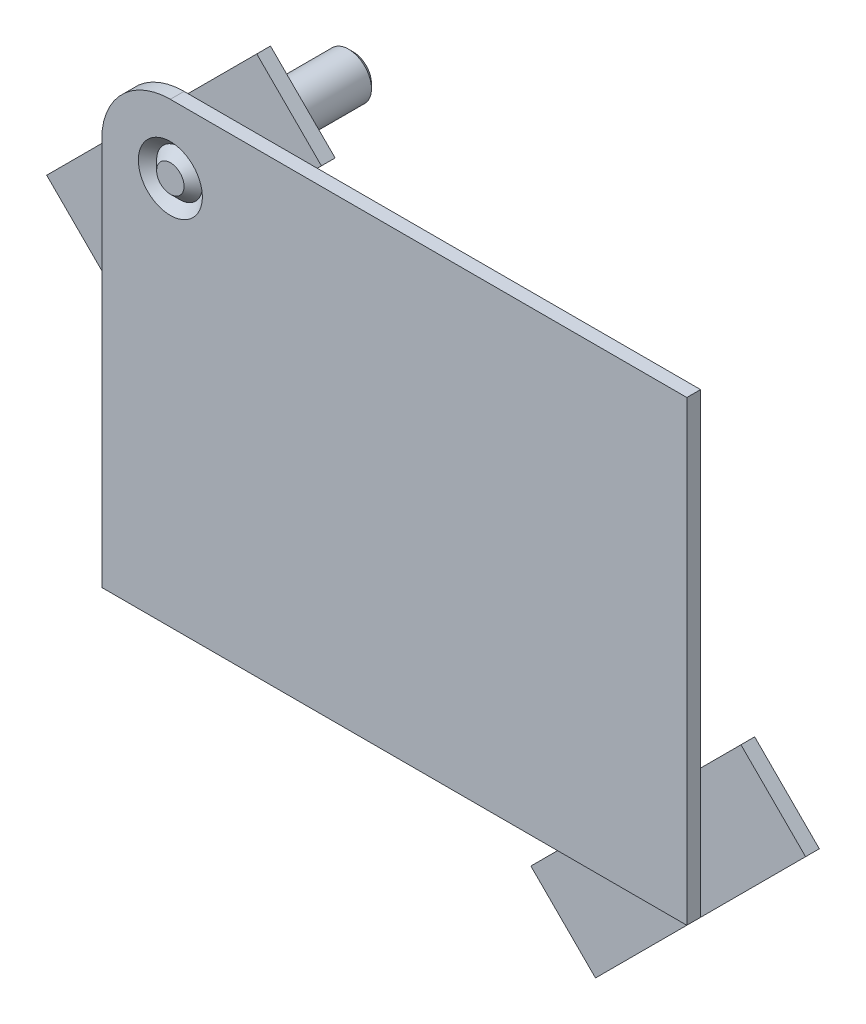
ISO-10303-21;
HEADER;
FILE_DESCRIPTION(('STEP AP214'),'2;1');
FILE_NAME('part.step','',(''),(''),'','','');
FILE_SCHEMA(('AUTOMOTIVE_DESIGN { 1 0 10303 214 1 1 1 1 }'));
ENDSEC;
DATA;
#1=APPLICATION_CONTEXT('core data for automotive mechanical design processes');
#2=APPLICATION_PROTOCOL_DEFINITION('international standard','automotive_design',2000,#1);
#3=PRODUCT_CONTEXT('',#1,'mechanical');
#4=PRODUCT('Part','Part','',(#3));
#5=PRODUCT_RELATED_PRODUCT_CATEGORY('part','',(#4));
#6=PRODUCT_DEFINITION_FORMATION('','',#4);
#7=PRODUCT_DEFINITION_CONTEXT('part definition',#1,'design');
#8=PRODUCT_DEFINITION('design','',#6,#7);
#9=PRODUCT_DEFINITION_SHAPE('','',#8);
#10=(LENGTH_UNIT() NAMED_UNIT(*) SI_UNIT(.MILLI.,.METRE.));
#11=(NAMED_UNIT(*) PLANE_ANGLE_UNIT() SI_UNIT($,.RADIAN.));
#12=(NAMED_UNIT(*) SI_UNIT($,.STERADIAN.) SOLID_ANGLE_UNIT());
#13=UNCERTAINTY_MEASURE_WITH_UNIT(LENGTH_MEASURE(1.E-05),#10,'distance_accuracy_value','');
#14=(GEOMETRIC_REPRESENTATION_CONTEXT(3) GLOBAL_UNCERTAINTY_ASSIGNED_CONTEXT((#13)) GLOBAL_UNIT_ASSIGNED_CONTEXT((#10,
#11,#12)) REPRESENTATION_CONTEXT('',''));
#15=CARTESIAN_POINT('',(0.,0.,0.));
#16=DIRECTION('',(0.,0.,1.));
#17=DIRECTION('',(1.,0.,0.));
#18=AXIS2_PLACEMENT_3D('',#15,#16,#17);
#19=CARTESIAN_POINT('',(-22.7615423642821,21.3249619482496,-3.));
#20=DIRECTION('',(0.,0.,1.));
#21=DIRECTION('',(1.,0.,0.));
#22=AXIS2_PLACEMENT_3D('',#19,#20,#21);
#23=CYLINDRICAL_SURFACE('',#22,5.);
#24=CARTESIAN_POINT('',(-22.7615423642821,21.3249619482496,1.));
#25=DIRECTION('',(0.,0.,1.));
#26=DIRECTION('',(1.,0.,0.));
#27=AXIS2_PLACEMENT_3D('',#24,#25,#26);
#28=CIRCLE('',#27,4.99999999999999);
#29=CARTESIAN_POINT('',(-17.7615423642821,21.3249619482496,1.));
#30=VERTEX_POINT('',#29);
#31=EDGE_CURVE('E43',#30,#30,#28,.T.);
#32=ORIENTED_EDGE('',*,*,#31,.F.);
#33=EDGE_LOOP('',(#32));
#34=FACE_BOUND('',#33,.T.);
#35=CARTESIAN_POINT('',(-22.7615423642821,21.3249619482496,0.));
#36=DIRECTION('',(0.,0.,-1.));
#37=DIRECTION('',(-1.,0.,0.));
#38=AXIS2_PLACEMENT_3D('',#35,#36,#37);
#39=CIRCLE('',#38,5.);
#40=CARTESIAN_POINT('',(-27.7615423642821,21.3249619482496,0.));
#41=VERTEX_POINT('',#40);
#42=EDGE_CURVE('E47',#41,#41,#39,.F.);
#43=ORIENTED_EDGE('',*,*,#42,.T.);
#44=EDGE_LOOP('',(#43));
#45=FACE_BOUND('',#44,.T.);
#46=ADVANCED_FACE('F37',(#34,#45),#23,.T.);
#47=CARTESIAN_POINT('',(-22.7615423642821,21.3249619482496,3.));
#48=DIRECTION('',(0.,0.,-1.));
#49=DIRECTION('',(-1.,0.,0.));
#50=AXIS2_PLACEMENT_3D('',#47,#48,#49);
#51=CONICAL_SURFACE('',#50,3.,0.785398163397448);
#52=ORIENTED_EDGE('',*,*,#31,.T.);
#53=EDGE_LOOP('',(#52));
#54=FACE_BOUND('',#53,.T.);
#55=CARTESIAN_POINT('',(-22.7615423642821,21.3249619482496,3.));
#56=DIRECTION('',(0.,0.,1.));
#57=DIRECTION('',(1.,0.,0.));
#58=AXIS2_PLACEMENT_3D('',#55,#56,#57);
#59=CIRCLE('',#58,3.);
#60=CARTESIAN_POINT('',(-19.7615423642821,21.3249619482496,3.));
#61=VERTEX_POINT('',#60);
#62=EDGE_CURVE('E11',#61,#61,#59,.T.);
#63=ORIENTED_EDGE('',*,*,#62,.F.);
#64=EDGE_LOOP('',(#63));
#65=FACE_BOUND('',#64,.T.);
#66=ADVANCED_FACE('F61',(#54,#65),#51,.T.);
#67=CARTESIAN_POINT('',(-22.7615423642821,21.9642233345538,3.));
#68=DIRECTION('',(0.,0.,1.));
#69=DIRECTION('',(1.,0.,0.));
#70=AXIS2_PLACEMENT_3D('',#67,#68,#69);
#71=PLANE('',#70);
#72=ORIENTED_EDGE('',*,*,#62,.T.);
#73=EDGE_LOOP('',(#72));
#74=FACE_BOUND('',#73,.T.);
#75=ADVANCED_FACE('F57',(#74),#71,.T.);
#76=CARTESIAN_POINT('',(-22.7615423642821,21.3249619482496,0.));
#77=DIRECTION('',(0.,0.,-1.));
#78=DIRECTION('',(-1.,0.,0.));
#79=AXIS2_PLACEMENT_3D('',#76,#77,#78);
#80=PLANE('',#79);
#81=ORIENTED_EDGE('',*,*,#42,.F.);
#82=EDGE_LOOP('',(#81));
#83=FACE_BOUND('',#82,.T.);
#84=ADVANCED_FACE('F55',(#83),#80,.T.);
#85=CLOSED_SHELL('',(#46,#66,#75,#84));
#86=MANIFOLD_SOLID_BREP('B2',#85);
#87=CARTESIAN_POINT('',(-22.7615423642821,25.3249619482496,-37.));
#88=DIRECTION('',(0.,0.,-1.));
#89=DIRECTION('',(-1.,0.,0.));
#90=AXIS2_PLACEMENT_3D('',#87,#88,#89);
#91=PLANE('',#90);
#92=CARTESIAN_POINT('',(-22.7615423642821,21.3249619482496,-37.));
#93=DIRECTION('',(0.,0.,1.));
#94=DIRECTION('',(1.,0.,0.));
#95=AXIS2_PLACEMENT_3D('',#92,#93,#94);
#96=CIRCLE('',#95,4.);
#97=CARTESIAN_POINT('',(-18.7615423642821,21.3249619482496,-37.));
#98=VERTEX_POINT('',#97);
#99=EDGE_CURVE('E36',#98,#98,#96,.T.);
#100=ORIENTED_EDGE('',*,*,#99,.F.);
#101=EDGE_LOOP('',(#100));
#102=FACE_BOUND('',#101,.T.);
#103=ADVANCED_FACE('F105',(#102),#91,.T.);
#104=CARTESIAN_POINT('',(-22.7615423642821,21.3249619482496,-36.));
#105=DIRECTION('',(0.,0.,1.));
#106=DIRECTION('',(1.,0.,0.));
#107=AXIS2_PLACEMENT_3D('',#104,#105,#106);
#108=CONICAL_SURFACE('',#107,5.,0.785398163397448);
#109=ORIENTED_EDGE('',*,*,#99,.T.);
#110=EDGE_LOOP('',(#109));
#111=FACE_BOUND('',#110,.T.);
#112=CARTESIAN_POINT('',(-22.7615423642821,21.3249619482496,-36.));
#113=DIRECTION('',(0.,0.,1.));
#114=DIRECTION('',(1.,0.,0.));
#115=AXIS2_PLACEMENT_3D('',#112,#113,#114);
#116=CIRCLE('',#115,5.);
#117=CARTESIAN_POINT('',(-17.7615423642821,21.3249619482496,-36.));
#118=VERTEX_POINT('',#117);
#119=EDGE_CURVE('E112',#118,#118,#116,.T.);
#120=ORIENTED_EDGE('',*,*,#119,.F.);
#121=EDGE_LOOP('',(#120));
#122=FACE_BOUND('',#121,.T.);
#123=ADVANCED_FACE('F126',(#111,#122),#108,.T.);
#124=CARTESIAN_POINT('',(-22.7615423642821,21.3249619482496,-3.));
#125=DIRECTION('',(0.,0.,1.));
#126=DIRECTION('',(1.,0.,0.));
#127=AXIS2_PLACEMENT_3D('',#124,#125,#126);
#128=CYLINDRICAL_SURFACE('',#127,5.);
#129=CARTESIAN_POINT('',(-22.7615423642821,21.3249619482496,-3.));
#130=DIRECTION('',(0.,0.,-1.));
#131=DIRECTION('',(-1.,0.,0.));
#132=AXIS2_PLACEMENT_3D('',#129,#130,#131);
#133=CIRCLE('',#132,5.);
#134=CARTESIAN_POINT('',(-27.7615423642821,21.3249619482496,-3.));
#135=VERTEX_POINT('',#134);
#136=EDGE_CURVE('E108',#135,#135,#133,.F.);
#137=ORIENTED_EDGE('',*,*,#136,.F.);
#138=EDGE_LOOP('',(#137));
#139=FACE_BOUND('',#138,.T.);
#140=ORIENTED_EDGE('',*,*,#119,.T.);
#141=EDGE_LOOP('',(#140));
#142=FACE_BOUND('',#141,.T.);
#143=ADVANCED_FACE('F124',(#139,#142),#128,.T.);
#144=CARTESIAN_POINT('',(-22.7615423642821,21.3249619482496,-3.));
#145=DIRECTION('',(0.,0.,-1.));
#146=DIRECTION('',(-1.,0.,0.));
#147=AXIS2_PLACEMENT_3D('',#144,#145,#146);
#148=PLANE('',#147);
#149=ORIENTED_EDGE('',*,*,#136,.T.);
#150=EDGE_LOOP('',(#149));
#151=FACE_BOUND('',#150,.T.);
#152=ADVANCED_FACE('F122',(#151),#148,.F.);
#153=CLOSED_SHELL('',(#103,#123,#143,#152));
#154=MANIFOLD_SOLID_BREP('B6',#153);
#155=CARTESIAN_POINT('',(7.29049583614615,37.234864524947,-3.));
#156=DIRECTION('',(-0.707106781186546,-0.707106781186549,0.));
#157=DIRECTION('',(0.707106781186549,-0.707106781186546,0.));
#158=AXIS2_PLACEMENT_3D('',#155,#156,#157);
#159=PLANE('',#158);
#160=DIRECTION('',(0.707106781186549,-0.707106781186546,0.));
#161=VECTOR('',#160,1.);
#162=CARTESIAN_POINT('',(7.29049583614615,37.234864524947,0.));
#163=LINE('',#162,#161);
#164=CARTESIAN_POINT('',(-6.85163978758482,51.3770001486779,0.));
#165=VERTEX_POINT('',#164);
#166=CARTESIAN_POINT('',(7.29049583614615,37.234864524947,0.));
#167=VERTEX_POINT('',#166);
#168=EDGE_CURVE('E214',#165,#167,#163,.T.);
#169=ORIENTED_EDGE('',*,*,#168,.T.);
#170=DIRECTION('',(0.,0.,1.));
#171=VECTOR('',#170,1.);
#172=CARTESIAN_POINT('',(7.29049583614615,37.234864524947,-3.));
#173=LINE('',#172,#171);
#174=CARTESIAN_POINT('',(7.29049583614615,37.234864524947,-3.));
#175=VERTEX_POINT('',#174);
#176=EDGE_CURVE('E103',#175,#167,#173,.T.);
#177=ORIENTED_EDGE('',*,*,#176,.F.);
#178=DIRECTION('',(0.707106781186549,-0.707106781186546,0.));
#179=VECTOR('',#178,1.);
#180=CARTESIAN_POINT('',(7.29049583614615,37.234864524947,-3.));
#181=LINE('',#180,#179);
#182=CARTESIAN_POINT('',(-6.85163978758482,51.3770001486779,-3.));
#183=VERTEX_POINT('',#182);
#184=EDGE_CURVE('E237',#183,#175,#181,.T.);
#185=ORIENTED_EDGE('',*,*,#184,.F.);
#186=DIRECTION('',(0.,0.,1.));
#187=VECTOR('',#186,1.);
#188=CARTESIAN_POINT('',(-6.85163978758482,51.3770001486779,-3.));
#189=LINE('',#188,#187);
#190=EDGE_CURVE('E226',#183,#165,#189,.T.);
#191=ORIENTED_EDGE('',*,*,#190,.T.);
#192=EDGE_LOOP('',(#169,#177,#185,#191));
#193=FACE_BOUND('',#192,.T.);
#194=ADVANCED_FACE('F170',(#193),#159,.F.);
#195=CARTESIAN_POINT('',(7.29049583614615,37.234864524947,-3.));
#196=DIRECTION('',(-0.707106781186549,0.707106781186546,0.));
#197=DIRECTION('',(-0.707106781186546,-0.707106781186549,0.));
#198=AXIS2_PLACEMENT_3D('',#195,#196,#197);
#199=PLANE('',#198);
#200=DIRECTION('',(-0.707106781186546,-0.707106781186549,0.));
#201=VECTOR('',#200,1.);
#202=CARTESIAN_POINT('',(7.29049583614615,37.234864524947,0.));
#203=LINE('',#202,#201);
#204=CARTESIAN_POINT('',(-38.6714449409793,-8.72707625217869,0.));
#205=VERTEX_POINT('',#204);
#206=EDGE_CURVE('E210',#167,#205,#203,.T.);
#207=ORIENTED_EDGE('',*,*,#206,.T.);
#208=DIRECTION('',(0.,0.,1.));
#209=VECTOR('',#208,1.);
#210=CARTESIAN_POINT('',(-38.6714449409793,-8.72707625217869,-3.));
#211=LINE('',#210,#209);
#212=CARTESIAN_POINT('',(-38.6714449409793,-8.72707625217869,-3.));
#213=VERTEX_POINT('',#212);
#214=EDGE_CURVE('E177',#213,#205,#211,.T.);
#215=ORIENTED_EDGE('',*,*,#214,.F.);
#216=DIRECTION('',(-0.707106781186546,-0.707106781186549,0.));
#217=VECTOR('',#216,1.);
#218=CARTESIAN_POINT('',(7.29049583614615,37.234864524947,-3.));
#219=LINE('',#218,#217);
#220=EDGE_CURVE('E222',#175,#213,#219,.T.);
#221=ORIENTED_EDGE('',*,*,#220,.F.);
#222=ORIENTED_EDGE('',*,*,#176,.T.);
#223=EDGE_LOOP('',(#207,#215,#221,#222));
#224=FACE_BOUND('',#223,.T.);
#225=ADVANCED_FACE('F221',(#224),#199,.F.);
#226=CARTESIAN_POINT('',(-52.8135805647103,5.41505937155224,-3.));
#227=DIRECTION('',(0.707106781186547,0.707106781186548,0.));
#228=DIRECTION('',(-0.707106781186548,0.707106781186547,0.));
#229=AXIS2_PLACEMENT_3D('',#226,#227,#228);
#230=PLANE('',#229);
#231=DIRECTION('',(-0.707106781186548,0.707106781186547,0.));
#232=VECTOR('',#231,1.);
#233=CARTESIAN_POINT('',(-52.8135805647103,5.41505937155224,0.));
#234=LINE('',#233,#232);
#235=CARTESIAN_POINT('',(-52.8135805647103,5.41505937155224,0.));
#236=VERTEX_POINT('',#235);
#237=EDGE_CURVE('E215',#205,#236,#234,.T.);
#238=ORIENTED_EDGE('',*,*,#237,.T.);
#239=DIRECTION('',(0.,0.,1.));
#240=VECTOR('',#239,1.);
#241=CARTESIAN_POINT('',(-52.8135805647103,5.41505937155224,-3.));
#242=LINE('',#241,#240);
#243=CARTESIAN_POINT('',(-52.8135805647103,5.41505937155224,-3.));
#244=VERTEX_POINT('',#243);
#245=EDGE_CURVE('E243',#244,#236,#242,.T.);
#246=ORIENTED_EDGE('',*,*,#245,.F.);
#247=DIRECTION('',(-0.707106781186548,0.707106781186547,0.));
#248=VECTOR('',#247,1.);
#249=CARTESIAN_POINT('',(-52.8135805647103,5.41505937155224,-3.));
#250=LINE('',#249,#248);
#251=EDGE_CURVE('E189',#213,#244,#250,.T.);
#252=ORIENTED_EDGE('',*,*,#251,.F.);
#253=ORIENTED_EDGE('',*,*,#214,.T.);
#254=EDGE_LOOP('',(#238,#246,#252,#253));
#255=FACE_BOUND('',#254,.T.);
#256=ADVANCED_FACE('F246',(#255),#230,.F.);
#257=CARTESIAN_POINT('',(-6.85163978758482,51.3770001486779,-3.));
#258=DIRECTION('',(0.707106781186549,-0.707106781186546,0.));
#259=DIRECTION('',(0.707106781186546,0.707106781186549,0.));
#260=AXIS2_PLACEMENT_3D('',#257,#258,#259);
#261=PLANE('',#260);
#262=DIRECTION('',(0.707106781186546,0.707106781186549,0.));
#263=VECTOR('',#262,1.);
#264=CARTESIAN_POINT('',(-6.85163978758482,51.3770001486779,0.));
#265=LINE('',#264,#263);
#266=EDGE_CURVE('E235',#236,#165,#265,.T.);
#267=ORIENTED_EDGE('',*,*,#266,.T.);
#268=ORIENTED_EDGE('',*,*,#190,.F.);
#269=DIRECTION('',(0.707106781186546,0.707106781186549,0.));
#270=VECTOR('',#269,1.);
#271=CARTESIAN_POINT('',(-6.85163978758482,51.3770001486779,-3.));
#272=LINE('',#271,#270);
#273=EDGE_CURVE('E184',#244,#183,#272,.T.);
#274=ORIENTED_EDGE('',*,*,#273,.F.);
#275=ORIENTED_EDGE('',*,*,#245,.T.);
#276=EDGE_LOOP('',(#267,#268,#274,#275));
#277=FACE_BOUND('',#276,.T.);
#278=ADVANCED_FACE('F248',(#277),#261,.F.);
#279=CARTESIAN_POINT('',(-6.85163978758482,51.3770001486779,-3.));
#280=DIRECTION('',(0.,0.,1.));
#281=DIRECTION('',(1.,0.,0.));
#282=AXIS2_PLACEMENT_3D('',#279,#280,#281);
#283=PLANE('',#282);
#284=CARTESIAN_POINT('',(-22.7615423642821,21.3249619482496,-3.));
#285=DIRECTION('',(0.,0.,-1.));
#286=DIRECTION('',(-1.,0.,0.));
#287=AXIS2_PLACEMENT_3D('',#284,#285,#286);
#288=CIRCLE('',#287,6.5);
#289=CARTESIAN_POINT('',(-29.2615423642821,21.3249619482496,-3.));
#290=VERTEX_POINT('',#289);
#291=EDGE_CURVE('E230',#290,#290,#288,.T.);
#292=ORIENTED_EDGE('',*,*,#291,.F.);
#293=EDGE_LOOP('',(#292));
#294=FACE_BOUND('',#293,.T.);
#295=ORIENTED_EDGE('',*,*,#184,.T.);
#296=ORIENTED_EDGE('',*,*,#220,.T.);
#297=ORIENTED_EDGE('',*,*,#251,.T.);
#298=ORIENTED_EDGE('',*,*,#273,.T.);
#299=EDGE_LOOP('',(#295,#296,#297,#298));
#300=FACE_BOUND('',#299,.T.);
#301=ADVANCED_FACE('F249',(#294,#300),#283,.F.);
#302=CARTESIAN_POINT('',(-6.85163978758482,51.3770001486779,0.));
#303=DIRECTION('',(0.,0.,1.));
#304=DIRECTION('',(1.,0.,0.));
#305=AXIS2_PLACEMENT_3D('',#302,#303,#304);
#306=PLANE('',#305);
#307=CARTESIAN_POINT('',(-22.7615423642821,21.3249619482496,0.));
#308=DIRECTION('',(0.,0.,-1.));
#309=DIRECTION('',(-1.,0.,0.));
#310=AXIS2_PLACEMENT_3D('',#307,#308,#309);
#311=CIRCLE('',#310,6.5);
#312=CARTESIAN_POINT('',(-29.2615423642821,21.3249619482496,0.));
#313=VERTEX_POINT('',#312);
#314=EDGE_CURVE('E227',#313,#313,#311,.T.);
#315=ORIENTED_EDGE('',*,*,#314,.T.);
#316=EDGE_LOOP('',(#315));
#317=FACE_BOUND('',#316,.T.);
#318=ORIENTED_EDGE('',*,*,#168,.F.);
#319=ORIENTED_EDGE('',*,*,#266,.F.);
#320=ORIENTED_EDGE('',*,*,#237,.F.);
#321=ORIENTED_EDGE('',*,*,#206,.F.);
#322=EDGE_LOOP('',(#318,#319,#320,#321));
#323=FACE_BOUND('',#322,.T.);
#324=ADVANCED_FACE('F211',(#317,#323),#306,.T.);
#325=CARTESIAN_POINT('',(-22.7615423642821,21.3249619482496,0.));
#326=DIRECTION('',(0.,0.,-1.));
#327=DIRECTION('',(-1.,0.,0.));
#328=AXIS2_PLACEMENT_3D('',#325,#326,#327);
#329=CYLINDRICAL_SURFACE('',#328,6.5);
#330=ORIENTED_EDGE('',*,*,#314,.F.);
#331=EDGE_LOOP('',(#330));
#332=FACE_BOUND('',#331,.T.);
#333=ORIENTED_EDGE('',*,*,#291,.T.);
#334=EDGE_LOOP('',(#333));
#335=FACE_BOUND('',#334,.T.);
#336=ADVANCED_FACE('F257',(#332,#335),#329,.F.);
#337=CLOSED_SHELL('',(#194,#225,#256,#278,#301,#324,#336));
#338=MANIFOLD_SOLID_BREP('B31',#337);
#339=CARTESIAN_POINT('',(53.1153516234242,-72.5138728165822,-3.));
#340=DIRECTION('',(0.707106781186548,0.707106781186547,0.));
#341=DIRECTION('',(-0.707106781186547,0.707106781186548,0.));
#342=AXIS2_PLACEMENT_3D('',#339,#340,#341);
#343=PLANE('',#342);
#344=DIRECTION('',(-0.707106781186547,0.707106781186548,0.));
#345=VECTOR('',#344,1.);
#346=CARTESIAN_POINT('',(53.1153516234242,-72.5138728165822,0.));
#347=LINE('',#346,#345);
#348=CARTESIAN_POINT('',(67.2574872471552,-86.6560084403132,0.));
#349=VERTEX_POINT('',#348);
#350=CARTESIAN_POINT('',(53.1153516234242,-72.5138728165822,0.));
#351=VERTEX_POINT('',#350);
#352=EDGE_CURVE('E367',#349,#351,#347,.T.);
#353=ORIENTED_EDGE('',*,*,#352,.T.);
#354=DIRECTION('',(0.,0.,1.));
#355=VECTOR('',#354,1.);
#356=CARTESIAN_POINT('',(53.1153516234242,-72.5138728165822,-3.));
#357=LINE('',#356,#355);
#358=CARTESIAN_POINT('',(53.1153516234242,-72.5138728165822,-3.));
#359=VERTEX_POINT('',#358);
#360=EDGE_CURVE('E168',#359,#351,#357,.T.);
#361=ORIENTED_EDGE('',*,*,#360,.F.);
#362=DIRECTION('',(-0.707106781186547,0.707106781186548,0.));
#363=VECTOR('',#362,1.);
#364=CARTESIAN_POINT('',(53.1153516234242,-72.5138728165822,-3.));
#365=LINE('',#364,#363);
#366=CARTESIAN_POINT('',(67.2574872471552,-86.6560084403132,-3.));
#367=VERTEX_POINT('',#366);
#368=EDGE_CURVE('E385',#367,#359,#365,.T.);
#369=ORIENTED_EDGE('',*,*,#368,.F.);
#370=DIRECTION('',(0.,0.,1.));
#371=VECTOR('',#370,1.);
#372=CARTESIAN_POINT('',(67.2574872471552,-86.6560084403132,-3.));
#373=LINE('',#372,#371);
#374=EDGE_CURVE('E379',#367,#349,#373,.T.);
#375=ORIENTED_EDGE('',*,*,#374,.T.);
#376=EDGE_LOOP('',(#353,#361,#369,#375));
#377=FACE_BOUND('',#376,.T.);
#378=ADVANCED_FACE('F323',(#377),#343,.F.);
#379=CARTESIAN_POINT('',(99.0772924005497,-26.5519320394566,-3.));
#380=DIRECTION('',(0.707106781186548,-0.707106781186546,0.));
#381=DIRECTION('',(0.707106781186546,0.707106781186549,0.));
#382=AXIS2_PLACEMENT_3D('',#379,#380,#381);
#383=PLANE('',#382);
#384=DIRECTION('',(0.707106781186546,0.707106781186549,0.));
#385=VECTOR('',#384,1.);
#386=CARTESIAN_POINT('',(99.0772924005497,-26.5519320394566,0.));
#387=LINE('',#386,#385);
#388=CARTESIAN_POINT('',(99.0772924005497,-26.5519320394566,0.));
#389=VERTEX_POINT('',#388);
#390=EDGE_CURVE('E363',#351,#389,#387,.T.);
#391=ORIENTED_EDGE('',*,*,#390,.T.);
#392=DIRECTION('',(0.,0.,1.));
#393=VECTOR('',#392,1.);
#394=CARTESIAN_POINT('',(99.0772924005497,-26.5519320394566,-3.));
#395=LINE('',#394,#393);
#396=CARTESIAN_POINT('',(99.0772924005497,-26.5519320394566,-3.));
#397=VERTEX_POINT('',#396);
#398=EDGE_CURVE('E330',#397,#389,#395,.T.);
#399=ORIENTED_EDGE('',*,*,#398,.F.);
#400=DIRECTION('',(0.707106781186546,0.707106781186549,0.));
#401=VECTOR('',#400,1.);
#402=CARTESIAN_POINT('',(99.0772924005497,-26.5519320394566,-3.));
#403=LINE('',#402,#401);
#404=EDGE_CURVE('E375',#359,#397,#403,.T.);
#405=ORIENTED_EDGE('',*,*,#404,.F.);
#406=ORIENTED_EDGE('',*,*,#360,.T.);
#407=EDGE_LOOP('',(#391,#399,#405,#406));
#408=FACE_BOUND('',#407,.T.);
#409=ADVANCED_FACE('F374',(#408),#383,.F.);
#410=CARTESIAN_POINT('',(113.219428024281,-40.6940676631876,-3.));
#411=DIRECTION('',(-0.707106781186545,-0.70710678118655,0.));
#412=DIRECTION('',(0.70710678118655,-0.707106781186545,0.));
#413=AXIS2_PLACEMENT_3D('',#410,#411,#412);
#414=PLANE('',#413);
#415=DIRECTION('',(0.70710678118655,-0.707106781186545,0.));
#416=VECTOR('',#415,1.);
#417=CARTESIAN_POINT('',(113.219428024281,-40.6940676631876,0.));
#418=LINE('',#417,#416);
#419=CARTESIAN_POINT('',(113.219428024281,-40.6940676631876,0.));
#420=VERTEX_POINT('',#419);
#421=EDGE_CURVE('E368',#389,#420,#418,.T.);
#422=ORIENTED_EDGE('',*,*,#421,.T.);
#423=DIRECTION('',(0.,0.,1.));
#424=VECTOR('',#423,1.);
#425=CARTESIAN_POINT('',(113.219428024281,-40.6940676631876,-3.));
#426=LINE('',#425,#424);
#427=CARTESIAN_POINT('',(113.219428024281,-40.6940676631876,-3.));
#428=VERTEX_POINT('',#427);
#429=EDGE_CURVE('E391',#428,#420,#426,.T.);
#430=ORIENTED_EDGE('',*,*,#429,.F.);
#431=DIRECTION('',(0.70710678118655,-0.707106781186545,0.));
#432=VECTOR('',#431,1.);
#433=CARTESIAN_POINT('',(113.219428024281,-40.6940676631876,-3.));
#434=LINE('',#433,#432);
#435=EDGE_CURVE('E342',#397,#428,#434,.T.);
#436=ORIENTED_EDGE('',*,*,#435,.F.);
#437=ORIENTED_EDGE('',*,*,#398,.T.);
#438=EDGE_LOOP('',(#422,#430,#436,#437));
#439=FACE_BOUND('',#438,.T.);
#440=ADVANCED_FACE('F394',(#439),#414,.F.);
#441=CARTESIAN_POINT('',(67.2574872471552,-86.6560084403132,-3.));
#442=DIRECTION('',(-0.707106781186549,0.707106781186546,0.));
#443=DIRECTION('',(-0.707106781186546,-0.707106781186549,0.));
#444=AXIS2_PLACEMENT_3D('',#441,#442,#443);
#445=PLANE('',#444);
#446=DIRECTION('',(-0.707106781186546,-0.707106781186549,0.));
#447=VECTOR('',#446,1.);
#448=CARTESIAN_POINT('',(67.2574872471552,-86.6560084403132,0.));
#449=LINE('',#448,#447);
#450=EDGE_CURVE('E383',#420,#349,#449,.T.);
#451=ORIENTED_EDGE('',*,*,#450,.T.);
#452=ORIENTED_EDGE('',*,*,#374,.F.);
#453=DIRECTION('',(-0.707106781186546,-0.707106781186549,0.));
#454=VECTOR('',#453,1.);
#455=CARTESIAN_POINT('',(67.2574872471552,-86.6560084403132,-3.));
#456=LINE('',#455,#454);
#457=EDGE_CURVE('E337',#428,#367,#456,.T.);
#458=ORIENTED_EDGE('',*,*,#457,.F.);
#459=ORIENTED_EDGE('',*,*,#429,.T.);
#460=EDGE_LOOP('',(#451,#452,#458,#459));
#461=FACE_BOUND('',#460,.T.);
#462=ADVANCED_FACE('F396',(#461),#445,.F.);
#463=CARTESIAN_POINT('',(53.1153516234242,-72.5138728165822,-3.));
#464=DIRECTION('',(0.,0.,-1.));
#465=DIRECTION('',(-1.,0.,0.));
#466=AXIS2_PLACEMENT_3D('',#463,#464,#465);
#467=PLANE('',#466);
#468=ORIENTED_EDGE('',*,*,#368,.T.);
#469=ORIENTED_EDGE('',*,*,#404,.T.);
#470=ORIENTED_EDGE('',*,*,#435,.T.);
#471=ORIENTED_EDGE('',*,*,#457,.T.);
#472=EDGE_LOOP('',(#468,#469,#470,#471));
#473=FACE_BOUND('',#472,.T.);
#474=ADVANCED_FACE('F397',(#473),#467,.T.);
#475=CARTESIAN_POINT('',(53.1153516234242,-72.5138728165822,0.));
#476=DIRECTION('',(0.,0.,-1.));
#477=DIRECTION('',(-1.,0.,0.));
#478=AXIS2_PLACEMENT_3D('',#475,#476,#477);
#479=PLANE('',#478);
#480=ORIENTED_EDGE('',*,*,#352,.F.);
#481=ORIENTED_EDGE('',*,*,#450,.F.);
#482=ORIENTED_EDGE('',*,*,#421,.F.);
#483=ORIENTED_EDGE('',*,*,#390,.F.);
#484=EDGE_LOOP('',(#480,#481,#482,#483));
#485=FACE_BOUND('',#484,.T.);
#486=ADVANCED_FACE('F364',(#485),#479,.F.);
#487=CLOSED_SHELL('',(#378,#409,#440,#462,#474,#486));
#488=MANIFOLD_SOLID_BREP('B97',#487);
#489=CARTESIAN_POINT('',(90.2384576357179,36.3249619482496,3.));
#490=DIRECTION('',(-1.,0.,0.));
#491=DIRECTION('',(0.,-1.,0.));
#492=AXIS2_PLACEMENT_3D('',#489,#490,#491);
#493=PLANE('',#492);
#494=DIRECTION('',(0.,1.,0.));
#495=VECTOR('',#494,1.);
#496=CARTESIAN_POINT('',(90.2384576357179,36.3249619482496,0.));
#497=LINE('',#496,#495);
#498=CARTESIAN_POINT('',(90.2384576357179,-63.6750380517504,0.));
#499=VERTEX_POINT('',#498);
#500=CARTESIAN_POINT('',(90.2384576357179,36.3249619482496,0.));
#501=VERTEX_POINT('',#500);
#502=EDGE_CURVE('E498',#499,#501,#497,.T.);
#503=ORIENTED_EDGE('',*,*,#502,.T.);
#504=DIRECTION('',(0.,0.,-1.));
#505=VECTOR('',#504,1.);
#506=CARTESIAN_POINT('',(90.2384576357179,36.3249619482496,3.));
#507=LINE('',#506,#505);
#508=CARTESIAN_POINT('',(90.2384576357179,36.3249619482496,3.));
#509=VERTEX_POINT('',#508);
#510=EDGE_CURVE('E506',#509,#501,#507,.T.);
#511=ORIENTED_EDGE('',*,*,#510,.F.);
#512=DIRECTION('',(0.,1.,0.));
#513=VECTOR('',#512,1.);
#514=CARTESIAN_POINT('',(90.2384576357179,36.3249619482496,3.));
#515=LINE('',#514,#513);
#516=CARTESIAN_POINT('',(90.2384576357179,-63.6750380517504,3.));
#517=VERTEX_POINT('',#516);
#518=EDGE_CURVE('E525',#517,#509,#515,.T.);
#519=ORIENTED_EDGE('',*,*,#518,.F.);
#520=DIRECTION('',(0.,0.,-1.));
#521=VECTOR('',#520,1.);
#522=CARTESIAN_POINT('',(90.2384576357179,-63.6750380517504,3.));
#523=LINE('',#522,#521);
#524=EDGE_CURVE('E514',#517,#499,#523,.T.);
#525=ORIENTED_EDGE('',*,*,#524,.T.);
#526=EDGE_LOOP('',(#503,#511,#519,#525));
#527=FACE_BOUND('',#526,.T.);
#528=ADVANCED_FACE('F446',(#527),#493,.F.);
#529=CARTESIAN_POINT('',(-22.761542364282,36.3249619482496,3.));
#530=DIRECTION('',(0.,-1.,0.));
#531=DIRECTION('',(0.,0.,-1.));
#532=AXIS2_PLACEMENT_3D('',#529,#530,#531);
#533=PLANE('',#532);
#534=DIRECTION('',(-1.,0.,0.));
#535=VECTOR('',#534,1.);
#536=CARTESIAN_POINT('',(-22.761542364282,36.3249619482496,0.));
#537=LINE('',#536,#535);
#538=CARTESIAN_POINT('',(-22.761542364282,36.3249619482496,0.));
#539=VERTEX_POINT('',#538);
#540=EDGE_CURVE('E492',#501,#539,#537,.T.);
#541=ORIENTED_EDGE('',*,*,#540,.T.);
#542=DIRECTION('',(0.,0.,-1.));
#543=VECTOR('',#542,1.);
#544=CARTESIAN_POINT('',(-22.761542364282,36.3249619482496,3.));
#545=LINE('',#544,#543);
#546=CARTESIAN_POINT('',(-22.761542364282,36.3249619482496,3.));
#547=VERTEX_POINT('',#546);
#548=EDGE_CURVE('E511',#547,#539,#545,.T.);
#549=ORIENTED_EDGE('',*,*,#548,.F.);
#550=DIRECTION('',(-1.,0.,0.));
#551=VECTOR('',#550,1.);
#552=CARTESIAN_POINT('',(-22.761542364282,36.3249619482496,3.));
#553=LINE('',#552,#551);
#554=EDGE_CURVE('E508',#509,#547,#553,.T.);
#555=ORIENTED_EDGE('',*,*,#554,.F.);
#556=ORIENTED_EDGE('',*,*,#510,.T.);
#557=EDGE_LOOP('',(#541,#549,#555,#556));
#558=FACE_BOUND('',#557,.T.);
#559=ADVANCED_FACE('F507',(#558),#533,.F.);
#560=CARTESIAN_POINT('',(-22.7615423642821,21.3249619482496,3.));
#561=DIRECTION('',(0.,0.,-1.));
#562=DIRECTION('',(-1.,0.,0.));
#563=AXIS2_PLACEMENT_3D('',#560,#561,#562);
#564=CYLINDRICAL_SURFACE('',#563,15.);
#565=CARTESIAN_POINT('',(-22.7615423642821,21.3249619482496,0.));
#566=DIRECTION('',(0.,0.,1.));
#567=DIRECTION('',(-1.,0.,0.));
#568=AXIS2_PLACEMENT_3D('',#565,#566,#567);
#569=CIRCLE('',#568,15.);
#570=CARTESIAN_POINT('',(-37.7615423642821,21.3249619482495,0.));
#571=VERTEX_POINT('',#570);
#572=EDGE_CURVE('E500',#539,#571,#569,.T.);
#573=ORIENTED_EDGE('',*,*,#572,.T.);
#574=DIRECTION('',(0.,0.,-1.));
#575=VECTOR('',#574,1.);
#576=CARTESIAN_POINT('',(-37.7615423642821,21.3249619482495,3.));
#577=LINE('',#576,#575);
#578=CARTESIAN_POINT('',(-37.7615423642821,21.3249619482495,3.));
#579=VERTEX_POINT('',#578);
#580=EDGE_CURVE('E536',#579,#571,#577,.T.);
#581=ORIENTED_EDGE('',*,*,#580,.F.);
#582=CARTESIAN_POINT('',(-22.7615423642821,21.3249619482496,3.));
#583=DIRECTION('',(0.,0.,1.));
#584=DIRECTION('',(-1.,0.,0.));
#585=AXIS2_PLACEMENT_3D('',#582,#583,#584);
#586=CIRCLE('',#585,15.);
#587=EDGE_CURVE('E528',#547,#579,#586,.T.);
#588=ORIENTED_EDGE('',*,*,#587,.F.);
#589=ORIENTED_EDGE('',*,*,#548,.T.);
#590=EDGE_LOOP('',(#573,#581,#588,#589));
#591=FACE_BOUND('',#590,.T.);
#592=ADVANCED_FACE('F558',(#591),#564,.T.);
#593=CARTESIAN_POINT('',(-37.7615423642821,21.3249619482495,3.));
#594=DIRECTION('',(1.,0.,0.));
#595=DIRECTION('',(0.,1.,0.));
#596=AXIS2_PLACEMENT_3D('',#593,#594,#595);
#597=PLANE('',#596);
#598=DIRECTION('',(0.,-1.,0.));
#599=VECTOR('',#598,1.);
#600=CARTESIAN_POINT('',(-37.7615423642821,21.3249619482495,0.));
#601=LINE('',#600,#599);
#602=CARTESIAN_POINT('',(-37.7615423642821,-63.6750380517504,0.));
#603=VERTEX_POINT('',#602);
#604=EDGE_CURVE('E521',#571,#603,#601,.T.);
#605=ORIENTED_EDGE('',*,*,#604,.T.);
#606=DIRECTION('',(0.,0.,-1.));
#607=VECTOR('',#606,1.);
#608=CARTESIAN_POINT('',(-37.7615423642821,-63.6750380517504,3.));
#609=LINE('',#608,#607);
#610=CARTESIAN_POINT('',(-37.7615423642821,-63.6750380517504,3.));
#611=VERTEX_POINT('',#610);
#612=EDGE_CURVE('E533',#611,#603,#609,.T.);
#613=ORIENTED_EDGE('',*,*,#612,.F.);
#614=DIRECTION('',(0.,-1.,0.));
#615=VECTOR('',#614,1.);
#616=CARTESIAN_POINT('',(-37.7615423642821,21.3249619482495,3.));
#617=LINE('',#616,#615);
#618=EDGE_CURVE('E465',#579,#611,#617,.T.);
#619=ORIENTED_EDGE('',*,*,#618,.F.);
#620=ORIENTED_EDGE('',*,*,#580,.T.);
#621=EDGE_LOOP('',(#605,#613,#619,#620));
#622=FACE_BOUND('',#621,.T.);
#623=ADVANCED_FACE('F562',(#622),#597,.F.);
#624=CARTESIAN_POINT('',(-37.7615423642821,-63.6750380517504,3.));
#625=DIRECTION('',(0.,1.,0.));
#626=DIRECTION('',(0.,0.,1.));
#627=AXIS2_PLACEMENT_3D('',#624,#625,#626);
#628=PLANE('',#627);
#629=DIRECTION('',(1.,0.,0.));
#630=VECTOR('',#629,1.);
#631=CARTESIAN_POINT('',(-37.7615423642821,-63.6750380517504,0.));
#632=LINE('',#631,#630);
#633=EDGE_CURVE('E523',#603,#499,#632,.T.);
#634=ORIENTED_EDGE('',*,*,#633,.T.);
#635=ORIENTED_EDGE('',*,*,#524,.F.);
#636=DIRECTION('',(1.,0.,0.));
#637=VECTOR('',#636,1.);
#638=CARTESIAN_POINT('',(-37.7615423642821,-63.6750380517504,3.));
#639=LINE('',#638,#637);
#640=EDGE_CURVE('E460',#611,#517,#639,.T.);
#641=ORIENTED_EDGE('',*,*,#640,.F.);
#642=ORIENTED_EDGE('',*,*,#612,.T.);
#643=EDGE_LOOP('',(#634,#635,#641,#642));
#644=FACE_BOUND('',#643,.T.);
#645=ADVANCED_FACE('F568',(#644),#628,.F.);
#646=CARTESIAN_POINT('',(-22.7615423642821,21.3249619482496,3.));
#647=DIRECTION('',(0.,0.,-1.));
#648=DIRECTION('',(-1.,0.,0.));
#649=AXIS2_PLACEMENT_3D('',#646,#647,#648);
#650=PLANE('',#649);
#651=CARTESIAN_POINT('',(-22.7615423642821,21.3249619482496,3.));
#652=DIRECTION('',(0.,0.,-1.));
#653=DIRECTION('',(-1.,0.,0.));
#654=AXIS2_PLACEMENT_3D('',#651,#652,#653);
#655=CIRCLE('',#654,7.00000000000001);
#656=CARTESIAN_POINT('',(-29.7615423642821,21.3249619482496,3.));
#657=VERTEX_POINT('',#656);
#658=EDGE_CURVE('E321',#657,#657,#655,.T.);
#659=ORIENTED_EDGE('',*,*,#658,.T.);
#660=EDGE_LOOP('',(#659));
#661=FACE_BOUND('',#660,.T.);
#662=ORIENTED_EDGE('',*,*,#518,.T.);
#663=ORIENTED_EDGE('',*,*,#554,.T.);
#664=ORIENTED_EDGE('',*,*,#587,.T.);
#665=ORIENTED_EDGE('',*,*,#618,.T.);
#666=ORIENTED_EDGE('',*,*,#640,.T.);
#667=EDGE_LOOP('',(#662,#663,#664,#665,#666));
#668=FACE_BOUND('',#667,.T.);
#669=ADVANCED_FACE('F572',(#661,#668),#650,.F.);
#670=CARTESIAN_POINT('',(-22.7615423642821,21.3249619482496,0.));
#671=DIRECTION('',(0.,0.,-1.));
#672=DIRECTION('',(-1.,0.,0.));
#673=AXIS2_PLACEMENT_3D('',#670,#671,#672);
#674=PLANE('',#673);
#675=ORIENTED_EDGE('',*,*,#502,.F.);
#676=ORIENTED_EDGE('',*,*,#633,.F.);
#677=ORIENTED_EDGE('',*,*,#604,.F.);
#678=ORIENTED_EDGE('',*,*,#572,.F.);
#679=ORIENTED_EDGE('',*,*,#540,.F.);
#680=EDGE_LOOP('',(#675,#676,#677,#678,#679));
#681=FACE_BOUND('',#680,.T.);
#682=CARTESIAN_POINT('',(-22.7615423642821,21.3249619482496,0.));
#683=DIRECTION('',(0.,0.,-1.));
#684=DIRECTION('',(-1.,0.,0.));
#685=AXIS2_PLACEMENT_3D('',#682,#683,#684);
#686=CIRCLE('',#685,5.);
#687=CARTESIAN_POINT('',(-27.7615423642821,21.3249619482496,0.));
#688=VERTEX_POINT('',#687);
#689=EDGE_CURVE('E515',#688,#688,#686,.T.);
#690=ORIENTED_EDGE('',*,*,#689,.F.);
#691=EDGE_LOOP('',(#690));
#692=FACE_BOUND('',#691,.T.);
#693=ADVANCED_FACE('F494',(#681,#692),#674,.T.);
#694=CARTESIAN_POINT('',(-22.7615423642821,21.3249619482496,-3.));
#695=DIRECTION('',(0.,0.,1.));
#696=DIRECTION('',(1.,0.,0.));
#697=AXIS2_PLACEMENT_3D('',#694,#695,#696);
#698=CYLINDRICAL_SURFACE('',#697,5.);
#699=CARTESIAN_POINT('',(-22.7615423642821,21.3249619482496,0.999999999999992));
#700=DIRECTION('',(0.,0.,-1.));
#701=DIRECTION('',(-1.,0.,0.));
#702=AXIS2_PLACEMENT_3D('',#699,#700,#701);
#703=CIRCLE('',#702,5.);
#704=CARTESIAN_POINT('',(-27.7615423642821,21.3249619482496,0.999999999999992));
#705=VERTEX_POINT('',#704);
#706=EDGE_CURVE('E453',#705,#705,#703,.F.);
#707=ORIENTED_EDGE('',*,*,#706,.T.);
#708=EDGE_LOOP('',(#707));
#709=FACE_BOUND('',#708,.T.);
#710=ORIENTED_EDGE('',*,*,#689,.T.);
#711=EDGE_LOOP('',(#710));
#712=FACE_BOUND('',#711,.T.);
#713=ADVANCED_FACE('F542',(#709,#712),#698,.F.);
#714=CARTESIAN_POINT('',(-22.7615423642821,21.3249619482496,0.999999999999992));
#715=DIRECTION('',(0.,0.,1.));
#716=DIRECTION('',(1.,0.,0.));
#717=AXIS2_PLACEMENT_3D('',#714,#715,#716);
#718=CONICAL_SURFACE('',#717,5.,0.785398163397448);
#719=ORIENTED_EDGE('',*,*,#658,.F.);
#720=EDGE_LOOP('',(#719));
#721=FACE_BOUND('',#720,.T.);
#722=ORIENTED_EDGE('',*,*,#706,.F.);
#723=EDGE_LOOP('',(#722));
#724=FACE_BOUND('',#723,.T.);
#725=ADVANCED_FACE('F545',(#721,#724),#718,.F.);
#726=CLOSED_SHELL('',(#528,#559,#592,#623,#645,#669,#693,#713,#725));
#727=MANIFOLD_SOLID_BREP('B162',#726);
#728=ADVANCED_BREP_SHAPE_REPRESENTATION('',(#18,#86,#154,#338,#488,#727),#14);
#729=SHAPE_DEFINITION_REPRESENTATION(#9,#728);
ENDSEC;
END-ISO-10303-21;
